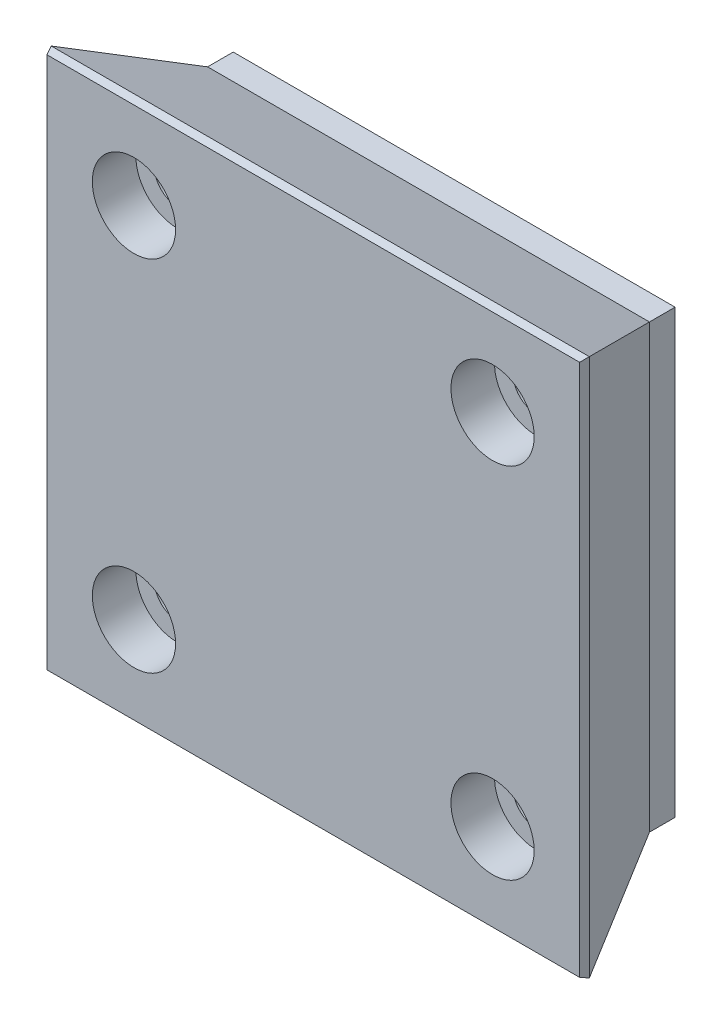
ISO-10303-21;
HEADER;
FILE_DESCRIPTION(('STEP AP214'),'2;1');
FILE_NAME('part.step','',(''),(''),'','','');
FILE_SCHEMA(('AUTOMOTIVE_DESIGN { 1 0 10303 214 1 1 1 1 }'));
ENDSEC;
DATA;
#1=APPLICATION_CONTEXT('core data for automotive mechanical design processes');
#2=APPLICATION_PROTOCOL_DEFINITION('international standard','automotive_design',2000,#1);
#3=PRODUCT_CONTEXT('',#1,'mechanical');
#4=PRODUCT('Part','Part','',(#3));
#5=PRODUCT_RELATED_PRODUCT_CATEGORY('part','',(#4));
#6=PRODUCT_DEFINITION_FORMATION('','',#4);
#7=PRODUCT_DEFINITION_CONTEXT('part definition',#1,'design');
#8=PRODUCT_DEFINITION('design','',#6,#7);
#9=PRODUCT_DEFINITION_SHAPE('','',#8);
#10=(LENGTH_UNIT() NAMED_UNIT(*) SI_UNIT(.MILLI.,.METRE.));
#11=(NAMED_UNIT(*) PLANE_ANGLE_UNIT() SI_UNIT($,.RADIAN.));
#12=(NAMED_UNIT(*) SI_UNIT($,.STERADIAN.) SOLID_ANGLE_UNIT());
#13=UNCERTAINTY_MEASURE_WITH_UNIT(LENGTH_MEASURE(1.E-05),#10,'distance_accuracy_value','');
#14=(GEOMETRIC_REPRESENTATION_CONTEXT(3) GLOBAL_UNCERTAINTY_ASSIGNED_CONTEXT((#13)) GLOBAL_UNIT_ASSIGNED_CONTEXT((#10,
#11,#12)) REPRESENTATION_CONTEXT('',''));
#15=CARTESIAN_POINT('',(0.,0.,0.));
#16=DIRECTION('',(0.,0.,1.));
#17=DIRECTION('',(1.,0.,0.));
#18=AXIS2_PLACEMENT_3D('',#15,#16,#17);
#19=CARTESIAN_POINT('',(17.25,-17.25,2.));
#20=DIRECTION('',(-1.,0.,0.));
#21=DIRECTION('',(0.,0.,1.));
#22=AXIS2_PLACEMENT_3D('',#19,#20,#21);
#23=PLANE('',#22);
#24=DIRECTION('',(0.,1.,0.));
#25=VECTOR('',#24,1.);
#26=CARTESIAN_POINT('',(17.25,-17.25,0.));
#27=LINE('',#26,#25);
#28=CARTESIAN_POINT('',(17.25,-17.25,0.));
#29=VERTEX_POINT('',#28);
#30=CARTESIAN_POINT('',(17.25,17.25,0.));
#31=VERTEX_POINT('',#30);
#32=EDGE_CURVE('E123',#29,#31,#27,.T.);
#33=ORIENTED_EDGE('',*,*,#32,.T.);
#34=DIRECTION('',(0.,0.,-1.));
#35=VECTOR('',#34,1.);
#36=CARTESIAN_POINT('',(17.25,17.25,2.));
#37=LINE('',#36,#35);
#38=CARTESIAN_POINT('',(17.25,17.25,2.));
#39=VERTEX_POINT('',#38);
#40=EDGE_CURVE('E131',#39,#31,#37,.T.);
#41=ORIENTED_EDGE('',*,*,#40,.F.);
#42=DIRECTION('',(0.,1.,0.));
#43=VECTOR('',#42,1.);
#44=CARTESIAN_POINT('',(17.25,0.,2.));
#45=LINE('',#44,#43);
#46=CARTESIAN_POINT('',(17.25,-17.25,2.));
#47=VERTEX_POINT('',#46);
#48=EDGE_CURVE('E155',#47,#39,#45,.T.);
#49=ORIENTED_EDGE('',*,*,#48,.F.);
#50=DIRECTION('',(0.,0.,-1.));
#51=VECTOR('',#50,1.);
#52=CARTESIAN_POINT('',(17.25,-17.25,2.));
#53=LINE('',#52,#51);
#54=EDGE_CURVE('E143',#47,#29,#53,.T.);
#55=ORIENTED_EDGE('',*,*,#54,.T.);
#56=EDGE_LOOP('',(#33,#41,#49,#55));
#57=FACE_BOUND('',#56,.T.);
#58=ADVANCED_FACE('F51',(#57),#23,.F.);
#59=CARTESIAN_POINT('',(-17.25,17.25,2.));
#60=DIRECTION('',(0.,-1.,0.));
#61=DIRECTION('',(0.,0.,-1.));
#62=AXIS2_PLACEMENT_3D('',#59,#60,#61);
#63=PLANE('',#62);
#64=DIRECTION('',(-1.,0.,0.));
#65=VECTOR('',#64,1.);
#66=CARTESIAN_POINT('',(-17.25,17.25,0.));
#67=LINE('',#66,#65);
#68=CARTESIAN_POINT('',(-17.25,17.25,0.));
#69=VERTEX_POINT('',#68);
#70=EDGE_CURVE('E118',#31,#69,#67,.T.);
#71=ORIENTED_EDGE('',*,*,#70,.T.);
#72=DIRECTION('',(0.,0.,-1.));
#73=VECTOR('',#72,1.);
#74=CARTESIAN_POINT('',(-17.25,17.25,2.));
#75=LINE('',#74,#73);
#76=CARTESIAN_POINT('',(-17.25,17.25,2.));
#77=VERTEX_POINT('',#76);
#78=EDGE_CURVE('E139',#77,#69,#75,.T.);
#79=ORIENTED_EDGE('',*,*,#78,.F.);
#80=DIRECTION('',(1.,0.,0.));
#81=VECTOR('',#80,1.);
#82=CARTESIAN_POINT('',(0.,17.25,2.));
#83=LINE('',#82,#81);
#84=EDGE_CURVE('E134',#39,#77,#83,.F.);
#85=ORIENTED_EDGE('',*,*,#84,.F.);
#86=ORIENTED_EDGE('',*,*,#40,.T.);
#87=EDGE_LOOP('',(#71,#79,#85,#86));
#88=FACE_BOUND('',#87,.T.);
#89=ADVANCED_FACE('F132',(#88),#63,.F.);
#90=CARTESIAN_POINT('',(-17.25,-17.25,2.));
#91=DIRECTION('',(1.,0.,0.));
#92=DIRECTION('',(0.,0.,-1.));
#93=AXIS2_PLACEMENT_3D('',#90,#91,#92);
#94=PLANE('',#93);
#95=DIRECTION('',(0.,-1.,0.));
#96=VECTOR('',#95,1.);
#97=CARTESIAN_POINT('',(-17.25,-17.25,0.));
#98=LINE('',#97,#96);
#99=CARTESIAN_POINT('',(-17.25,-17.25,0.));
#100=VERTEX_POINT('',#99);
#101=EDGE_CURVE('E124',#69,#100,#98,.T.);
#102=ORIENTED_EDGE('',*,*,#101,.T.);
#103=DIRECTION('',(0.,0.,-1.));
#104=VECTOR('',#103,1.);
#105=CARTESIAN_POINT('',(-17.25,-17.25,2.));
#106=LINE('',#105,#104);
#107=CARTESIAN_POINT('',(-17.25,-17.25,2.));
#108=VERTEX_POINT('',#107);
#109=EDGE_CURVE('E157',#108,#100,#106,.T.);
#110=ORIENTED_EDGE('',*,*,#109,.F.);
#111=DIRECTION('',(0.,1.,0.));
#112=VECTOR('',#111,1.);
#113=CARTESIAN_POINT('',(-17.25,0.,2.));
#114=LINE('',#113,#112);
#115=EDGE_CURVE('E165',#77,#108,#114,.F.);
#116=ORIENTED_EDGE('',*,*,#115,.F.);
#117=ORIENTED_EDGE('',*,*,#78,.T.);
#118=EDGE_LOOP('',(#102,#110,#116,#117));
#119=FACE_BOUND('',#118,.T.);
#120=ADVANCED_FACE('F247',(#119),#94,.F.);
#121=CARTESIAN_POINT('',(-17.25,-17.25,2.));
#122=DIRECTION('',(0.,1.,0.));
#123=DIRECTION('',(0.,0.,1.));
#124=AXIS2_PLACEMENT_3D('',#121,#122,#123);
#125=PLANE('',#124);
#126=DIRECTION('',(1.,0.,0.));
#127=VECTOR('',#126,1.);
#128=CARTESIAN_POINT('',(-17.25,-17.25,0.));
#129=LINE('',#128,#127);
#130=EDGE_CURVE('E153',#100,#29,#129,.T.);
#131=ORIENTED_EDGE('',*,*,#130,.T.);
#132=ORIENTED_EDGE('',*,*,#54,.F.);
#133=DIRECTION('',(1.,0.,0.));
#134=VECTOR('',#133,1.);
#135=CARTESIAN_POINT('',(0.,-17.25,2.));
#136=LINE('',#135,#134);
#137=EDGE_CURVE('E158',#108,#47,#136,.T.);
#138=ORIENTED_EDGE('',*,*,#137,.F.);
#139=ORIENTED_EDGE('',*,*,#109,.T.);
#140=EDGE_LOOP('',(#131,#132,#138,#139));
#141=FACE_BOUND('',#140,.T.);
#142=ADVANCED_FACE('F236',(#141),#125,.F.);
#143=CARTESIAN_POINT('',(0.,0.,0.));
#144=DIRECTION('',(0.,0.,-1.));
#145=DIRECTION('',(-1.,0.,0.));
#146=AXIS2_PLACEMENT_3D('',#143,#144,#145);
#147=PLANE('',#146);
#148=CARTESIAN_POINT('',(-14.,14.,0.));
#149=DIRECTION('',(0.,0.,1.));
#150=DIRECTION('',(1.,0.,0.));
#151=AXIS2_PLACEMENT_3D('',#148,#149,#150);
#152=CIRCLE('',#151,1.8);
#153=CARTESIAN_POINT('',(-12.2,14.,0.));
#154=VERTEX_POINT('',#153);
#155=EDGE_CURVE('E428',#154,#154,#152,.T.);
#156=ORIENTED_EDGE('',*,*,#155,.T.);
#157=EDGE_LOOP('',(#156));
#158=FACE_BOUND('',#157,.T.);
#159=CARTESIAN_POINT('',(14.,14.,0.));
#160=DIRECTION('',(0.,0.,1.));
#161=DIRECTION('',(1.,0.,0.));
#162=AXIS2_PLACEMENT_3D('',#159,#160,#161);
#163=CIRCLE('',#162,1.8);
#164=CARTESIAN_POINT('',(15.8,14.,0.));
#165=VERTEX_POINT('',#164);
#166=EDGE_CURVE('E440',#165,#165,#163,.T.);
#167=ORIENTED_EDGE('',*,*,#166,.T.);
#168=EDGE_LOOP('',(#167));
#169=FACE_BOUND('',#168,.T.);
#170=CARTESIAN_POINT('',(14.,-14.,0.));
#171=DIRECTION('',(0.,0.,1.));
#172=DIRECTION('',(1.,0.,0.));
#173=AXIS2_PLACEMENT_3D('',#170,#171,#172);
#174=CIRCLE('',#173,1.8);
#175=CARTESIAN_POINT('',(15.8,-14.,0.));
#176=VERTEX_POINT('',#175);
#177=EDGE_CURVE('E452',#176,#176,#174,.T.);
#178=ORIENTED_EDGE('',*,*,#177,.T.);
#179=EDGE_LOOP('',(#178));
#180=FACE_BOUND('',#179,.T.);
#181=CARTESIAN_POINT('',(-14.,-14.,0.));
#182=DIRECTION('',(0.,0.,1.));
#183=DIRECTION('',(1.,0.,0.));
#184=AXIS2_PLACEMENT_3D('',#181,#182,#183);
#185=CIRCLE('',#184,1.8);
#186=CARTESIAN_POINT('',(-12.2,-14.,0.));
#187=VERTEX_POINT('',#186);
#188=EDGE_CURVE('E185',#187,#187,#185,.T.);
#189=ORIENTED_EDGE('',*,*,#188,.T.);
#190=EDGE_LOOP('',(#189));
#191=FACE_BOUND('',#190,.T.);
#192=ORIENTED_EDGE('',*,*,#32,.F.);
#193=ORIENTED_EDGE('',*,*,#130,.F.);
#194=ORIENTED_EDGE('',*,*,#101,.F.);
#195=ORIENTED_EDGE('',*,*,#70,.F.);
#196=EDGE_LOOP('',(#192,#193,#194,#195));
#197=FACE_BOUND('',#196,.T.);
#198=ADVANCED_FACE('F120',(#158,#169,#180,#191,#197),#147,.T.);
#199=CARTESIAN_POINT('',(0.,0.,11.));
#200=DIRECTION('',(0.,0.,-1.));
#201=DIRECTION('',(-1.,0.,0.));
#202=AXIS2_PLACEMENT_3D('',#199,#200,#201);
#203=PLANE('',#202);
#204=CARTESIAN_POINT('',(-14.,14.,11.));
#205=DIRECTION('',(0.,0.,1.));
#206=DIRECTION('',(1.,0.,0.));
#207=AXIS2_PLACEMENT_3D('',#204,#205,#206);
#208=CIRCLE('',#207,3.25);
#209=CARTESIAN_POINT('',(-10.75,14.,11.));
#210=VERTEX_POINT('',#209);
#211=EDGE_CURVE('E421',#210,#210,#208,.T.);
#212=ORIENTED_EDGE('',*,*,#211,.F.);
#213=EDGE_LOOP('',(#212));
#214=FACE_BOUND('',#213,.T.);
#215=CARTESIAN_POINT('',(14.,14.,11.));
#216=DIRECTION('',(0.,0.,1.));
#217=DIRECTION('',(1.,0.,0.));
#218=AXIS2_PLACEMENT_3D('',#215,#216,#217);
#219=CIRCLE('',#218,3.25);
#220=CARTESIAN_POINT('',(17.25,14.,11.));
#221=VERTEX_POINT('',#220);
#222=EDGE_CURVE('E431',#221,#221,#219,.T.);
#223=ORIENTED_EDGE('',*,*,#222,.F.);
#224=EDGE_LOOP('',(#223));
#225=FACE_BOUND('',#224,.T.);
#226=CARTESIAN_POINT('',(14.,-14.,11.));
#227=DIRECTION('',(0.,0.,1.));
#228=DIRECTION('',(1.,0.,0.));
#229=AXIS2_PLACEMENT_3D('',#226,#227,#228);
#230=CIRCLE('',#229,3.25);
#231=CARTESIAN_POINT('',(17.25,-14.,11.));
#232=VERTEX_POINT('',#231);
#233=EDGE_CURVE('E443',#232,#232,#230,.T.);
#234=ORIENTED_EDGE('',*,*,#233,.F.);
#235=EDGE_LOOP('',(#234));
#236=FACE_BOUND('',#235,.T.);
#237=CARTESIAN_POINT('',(-14.,-14.,11.));
#238=DIRECTION('',(0.,0.,1.));
#239=DIRECTION('',(1.,0.,0.));
#240=AXIS2_PLACEMENT_3D('',#237,#238,#239);
#241=CIRCLE('',#240,3.25);
#242=CARTESIAN_POINT('',(-10.75,-14.,11.));
#243=VERTEX_POINT('',#242);
#244=EDGE_CURVE('E455',#243,#243,#241,.T.);
#245=ORIENTED_EDGE('',*,*,#244,.F.);
#246=EDGE_LOOP('',(#245));
#247=FACE_BOUND('',#246,.T.);
#248=DIRECTION('',(0.,-1.,0.));
#249=VECTOR('',#248,1.);
#250=CARTESIAN_POINT('',(-20.7954373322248,-21.25,11.));
#251=LINE('',#250,#249);
#252=CARTESIAN_POINT('',(-20.7954373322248,20.7954373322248,11.));
#253=VERTEX_POINT('',#252);
#254=CARTESIAN_POINT('',(-20.7954373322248,-20.7954373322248,11.));
#255=VERTEX_POINT('',#254);
#256=EDGE_CURVE('E172',#253,#255,#251,.T.);
#257=ORIENTED_EDGE('',*,*,#256,.T.);
#258=DIRECTION('',(1.,0.,0.));
#259=VECTOR('',#258,1.);
#260=CARTESIAN_POINT('',(21.25,-20.7954373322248,11.));
#261=LINE('',#260,#259);
#262=CARTESIAN_POINT('',(20.7954373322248,-20.7954373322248,11.));
#263=VERTEX_POINT('',#262);
#264=EDGE_CURVE('E174',#255,#263,#261,.T.);
#265=ORIENTED_EDGE('',*,*,#264,.T.);
#266=DIRECTION('',(0.,1.,0.));
#267=VECTOR('',#266,1.);
#268=CARTESIAN_POINT('',(20.7954373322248,21.25,11.));
#269=LINE('',#268,#267);
#270=CARTESIAN_POINT('',(20.7954373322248,20.7954373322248,11.));
#271=VERTEX_POINT('',#270);
#272=EDGE_CURVE('E138',#263,#271,#269,.T.);
#273=ORIENTED_EDGE('',*,*,#272,.T.);
#274=DIRECTION('',(-1.,0.,0.));
#275=VECTOR('',#274,1.);
#276=CARTESIAN_POINT('',(-21.25,20.7954373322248,11.));
#277=LINE('',#276,#275);
#278=EDGE_CURVE('E170',#271,#253,#277,.T.);
#279=ORIENTED_EDGE('',*,*,#278,.T.);
#280=EDGE_LOOP('',(#257,#265,#273,#279));
#281=FACE_BOUND('',#280,.T.);
#282=ADVANCED_FACE('F225',(#214,#225,#236,#247,#281),#203,.F.);
#283=CARTESIAN_POINT('',(-13.6623711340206,0.,-6.07216494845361));
#284=DIRECTION('',(-0.913811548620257,0.,-0.406138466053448));
#285=DIRECTION('',(-0.406138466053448,0.,0.913811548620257));
#286=AXIS2_PLACEMENT_3D('',#283,#284,#285);
#287=PLANE('',#286);
#288=DIRECTION('',(0.376288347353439,0.376288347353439,-0.846648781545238));
#289=VECTOR('',#288,1.);
#290=CARTESIAN_POINT('',(-21.25,-21.25,11.));
#291=LINE('',#290,#289);
#292=CARTESIAN_POINT('',(-21.0063169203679,-21.0063169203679,10.4517130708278));
#293=VERTEX_POINT('',#292);
#294=EDGE_CURVE('E178',#293,#108,#291,.T.);
#295=ORIENTED_EDGE('',*,*,#294,.F.);
#296=DIRECTION('',(0.,1.,0.));
#297=VECTOR('',#296,1.);
#298=CARTESIAN_POINT('',(-21.0063169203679,21.25,10.4517130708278));
#299=LINE('',#298,#297);
#300=CARTESIAN_POINT('',(-21.0063169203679,21.0063169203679,10.4517130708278));
#301=VERTEX_POINT('',#300);
#302=EDGE_CURVE('E76',#293,#301,#299,.T.);
#303=ORIENTED_EDGE('',*,*,#302,.T.);
#304=DIRECTION('',(0.376288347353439,-0.376288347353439,-0.846648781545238));
#305=VECTOR('',#304,1.);
#306=CARTESIAN_POINT('',(-21.25,21.25,11.));
#307=LINE('',#306,#305);
#308=EDGE_CURVE('E180',#301,#77,#307,.T.);
#309=ORIENTED_EDGE('',*,*,#308,.T.);
#310=ORIENTED_EDGE('',*,*,#115,.T.);
#311=EDGE_LOOP('',(#295,#303,#309,#310));
#312=FACE_BOUND('',#311,.T.);
#313=ADVANCED_FACE('F227',(#312),#287,.T.);
#314=CARTESIAN_POINT('',(0.,-13.6623711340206,-6.07216494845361));
#315=DIRECTION('',(0.,-0.913811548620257,-0.406138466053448));
#316=DIRECTION('',(0.,0.406138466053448,-0.913811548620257));
#317=AXIS2_PLACEMENT_3D('',#314,#315,#316);
#318=PLANE('',#317);
#319=DIRECTION('',(-0.376288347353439,0.376288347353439,-0.846648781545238));
#320=VECTOR('',#319,1.);
#321=CARTESIAN_POINT('',(21.25,-21.25,11.));
#322=LINE('',#321,#320);
#323=CARTESIAN_POINT('',(21.0063169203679,-21.0063169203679,10.4517130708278));
#324=VERTEX_POINT('',#323);
#325=EDGE_CURVE('E144',#324,#47,#322,.T.);
#326=ORIENTED_EDGE('',*,*,#325,.F.);
#327=DIRECTION('',(-1.,0.,0.));
#328=VECTOR('',#327,1.);
#329=CARTESIAN_POINT('',(-21.25,-21.0063169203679,10.4517130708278));
#330=LINE('',#329,#328);
#331=EDGE_CURVE('E177',#324,#293,#330,.T.);
#332=ORIENTED_EDGE('',*,*,#331,.T.);
#333=ORIENTED_EDGE('',*,*,#294,.T.);
#334=ORIENTED_EDGE('',*,*,#137,.T.);
#335=EDGE_LOOP('',(#326,#332,#333,#334));
#336=FACE_BOUND('',#335,.T.);
#337=ADVANCED_FACE('F219',(#336),#318,.T.);
#338=CARTESIAN_POINT('',(0.,13.6623711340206,-6.07216494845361));
#339=DIRECTION('',(0.,0.913811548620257,-0.406138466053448));
#340=DIRECTION('',(0.,0.406138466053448,0.913811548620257));
#341=AXIS2_PLACEMENT_3D('',#338,#339,#340);
#342=PLANE('',#341);
#343=ORIENTED_EDGE('',*,*,#308,.F.);
#344=DIRECTION('',(1.,0.,0.));
#345=VECTOR('',#344,1.);
#346=CARTESIAN_POINT('',(21.25,21.0063169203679,10.4517130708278));
#347=LINE('',#346,#345);
#348=CARTESIAN_POINT('',(21.0063169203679,21.0063169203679,10.4517130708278));
#349=VERTEX_POINT('',#348);
#350=EDGE_CURVE('E61',#301,#349,#347,.T.);
#351=ORIENTED_EDGE('',*,*,#350,.T.);
#352=DIRECTION('',(-0.376288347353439,-0.376288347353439,-0.846648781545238));
#353=VECTOR('',#352,1.);
#354=CARTESIAN_POINT('',(21.25,21.25,11.));
#355=LINE('',#354,#353);
#356=EDGE_CURVE('E146',#349,#39,#355,.T.);
#357=ORIENTED_EDGE('',*,*,#356,.T.);
#358=ORIENTED_EDGE('',*,*,#84,.T.);
#359=EDGE_LOOP('',(#343,#351,#357,#358));
#360=FACE_BOUND('',#359,.T.);
#361=ADVANCED_FACE('F271',(#360),#342,.T.);
#362=CARTESIAN_POINT('',(13.6623711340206,0.,-6.07216494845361));
#363=DIRECTION('',(0.913811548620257,0.,-0.406138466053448));
#364=DIRECTION('',(-0.406138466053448,0.,-0.913811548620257));
#365=AXIS2_PLACEMENT_3D('',#362,#363,#364);
#366=PLANE('',#365);
#367=ORIENTED_EDGE('',*,*,#356,.F.);
#368=DIRECTION('',(0.,-1.,0.));
#369=VECTOR('',#368,1.);
#370=CARTESIAN_POINT('',(21.0063169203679,-21.25,10.4517130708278));
#371=LINE('',#370,#369);
#372=EDGE_CURVE('E12',#349,#324,#371,.T.);
#373=ORIENTED_EDGE('',*,*,#372,.T.);
#374=ORIENTED_EDGE('',*,*,#325,.T.);
#375=ORIENTED_EDGE('',*,*,#48,.T.);
#376=EDGE_LOOP('',(#367,#373,#374,#375));
#377=FACE_BOUND('',#376,.T.);
#378=ADVANCED_FACE('F216',(#377),#366,.T.);
#379=CARTESIAN_POINT('',(0.,20.7954373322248,11.));
#380=DIRECTION('',(0.,0.933345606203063,0.358979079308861));
#381=DIRECTION('',(1.,0.,0.));
#382=AXIS2_PLACEMENT_3D('',#379,#380,#381);
#383=PLANE('',#382);
#384=DIRECTION('',(-0.337868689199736,-0.337868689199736,0.878458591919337));
#385=VECTOR('',#384,1.);
#386=CARTESIAN_POINT('',(18.4215289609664,18.4215289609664,17.1721617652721));
#387=LINE('',#386,#385);
#388=EDGE_CURVE('E197',#349,#271,#387,.T.);
#389=ORIENTED_EDGE('',*,*,#388,.F.);
#390=ORIENTED_EDGE('',*,*,#350,.F.);
#391=DIRECTION('',(0.337868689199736,-0.337868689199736,0.878458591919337));
#392=VECTOR('',#391,1.);
#393=CARTESIAN_POINT('',(-18.4215289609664,18.4215289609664,17.1721617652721));
#394=LINE('',#393,#392);
#395=EDGE_CURVE('E56',#253,#301,#394,.F.);
#396=ORIENTED_EDGE('',*,*,#395,.F.);
#397=ORIENTED_EDGE('',*,*,#278,.F.);
#398=EDGE_LOOP('',(#389,#390,#396,#397));
#399=FACE_BOUND('',#398,.T.);
#400=ADVANCED_FACE('F54',(#399),#383,.T.);
#401=CARTESIAN_POINT('',(-20.7954373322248,0.,11.));
#402=DIRECTION('',(-0.933345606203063,0.,0.358979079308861));
#403=DIRECTION('',(0.,1.,0.));
#404=AXIS2_PLACEMENT_3D('',#401,#402,#403);
#405=PLANE('',#404);
#406=ORIENTED_EDGE('',*,*,#395,.T.);
#407=ORIENTED_EDGE('',*,*,#302,.F.);
#408=DIRECTION('',(0.337868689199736,0.337868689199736,0.878458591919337));
#409=VECTOR('',#408,1.);
#410=CARTESIAN_POINT('',(-18.4215289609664,-18.4215289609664,17.1721617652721));
#411=LINE('',#410,#409);
#412=EDGE_CURVE('E196',#255,#293,#411,.F.);
#413=ORIENTED_EDGE('',*,*,#412,.F.);
#414=ORIENTED_EDGE('',*,*,#256,.F.);
#415=EDGE_LOOP('',(#406,#407,#413,#414));
#416=FACE_BOUND('',#415,.T.);
#417=ADVANCED_FACE('F207',(#416),#405,.T.);
#418=CARTESIAN_POINT('',(20.7954373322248,0.,11.));
#419=DIRECTION('',(0.933345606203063,0.,0.358979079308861));
#420=DIRECTION('',(0.,-1.,0.));
#421=AXIS2_PLACEMENT_3D('',#418,#419,#420);
#422=PLANE('',#421);
#423=ORIENTED_EDGE('',*,*,#388,.T.);
#424=ORIENTED_EDGE('',*,*,#272,.F.);
#425=DIRECTION('',(0.337868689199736,-0.337868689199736,-0.878458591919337));
#426=VECTOR('',#425,1.);
#427=CARTESIAN_POINT('',(18.4215289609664,-18.4215289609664,17.1721617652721));
#428=LINE('',#427,#426);
#429=EDGE_CURVE('E194',#324,#263,#428,.F.);
#430=ORIENTED_EDGE('',*,*,#429,.F.);
#431=ORIENTED_EDGE('',*,*,#372,.F.);
#432=EDGE_LOOP('',(#423,#424,#430,#431));
#433=FACE_BOUND('',#432,.T.);
#434=ADVANCED_FACE('F213',(#433),#422,.T.);
#435=CARTESIAN_POINT('',(0.,-20.7954373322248,11.));
#436=DIRECTION('',(0.,-0.933345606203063,0.358979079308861));
#437=DIRECTION('',(-1.,0.,0.));
#438=AXIS2_PLACEMENT_3D('',#435,#436,#437);
#439=PLANE('',#438);
#440=ORIENTED_EDGE('',*,*,#412,.T.);
#441=ORIENTED_EDGE('',*,*,#331,.F.);
#442=ORIENTED_EDGE('',*,*,#429,.T.);
#443=ORIENTED_EDGE('',*,*,#264,.F.);
#444=EDGE_LOOP('',(#440,#441,#442,#443));
#445=FACE_BOUND('',#444,.T.);
#446=ADVANCED_FACE('F222',(#445),#439,.T.);
#447=CARTESIAN_POINT('',(-14.,-14.,11.));
#448=DIRECTION('',(0.,0.,1.));
#449=DIRECTION('',(1.,0.,0.));
#450=AXIS2_PLACEMENT_3D('',#447,#448,#449);
#451=CYLINDRICAL_SURFACE('',#450,1.8);
#452=ORIENTED_EDGE('',*,*,#188,.F.);
#453=EDGE_LOOP('',(#452));
#454=FACE_BOUND('',#453,.T.);
#455=CARTESIAN_POINT('',(-14.,-14.,7.6));
#456=DIRECTION('',(0.,0.,1.));
#457=DIRECTION('',(1.,0.,0.));
#458=AXIS2_PLACEMENT_3D('',#455,#456,#457);
#459=CIRCLE('',#458,1.8);
#460=CARTESIAN_POINT('',(-12.2,-14.,7.6));
#461=VERTEX_POINT('',#460);
#462=EDGE_CURVE('E460',#461,#461,#459,.T.);
#463=ORIENTED_EDGE('',*,*,#462,.T.);
#464=EDGE_LOOP('',(#463));
#465=FACE_BOUND('',#464,.T.);
#466=ADVANCED_FACE('F257',(#454,#465),#451,.F.);
#467=CARTESIAN_POINT('',(-12.2,-14.,7.6));
#468=DIRECTION('',(0.,0.,-1.));
#469=DIRECTION('',(-1.,0.,0.));
#470=AXIS2_PLACEMENT_3D('',#467,#468,#469);
#471=PLANE('',#470);
#472=ORIENTED_EDGE('',*,*,#462,.F.);
#473=EDGE_LOOP('',(#472));
#474=FACE_BOUND('',#473,.T.);
#475=CARTESIAN_POINT('',(-14.,-14.,7.6));
#476=DIRECTION('',(0.,0.,1.));
#477=DIRECTION('',(1.,0.,0.));
#478=AXIS2_PLACEMENT_3D('',#475,#476,#477);
#479=CIRCLE('',#478,3.25);
#480=CARTESIAN_POINT('',(-10.75,-14.,7.6));
#481=VERTEX_POINT('',#480);
#482=EDGE_CURVE('E458',#481,#481,#479,.T.);
#483=ORIENTED_EDGE('',*,*,#482,.T.);
#484=EDGE_LOOP('',(#483));
#485=FACE_BOUND('',#484,.T.);
#486=ADVANCED_FACE('F327',(#474,#485),#471,.F.);
#487=CARTESIAN_POINT('',(-14.,-14.,11.));
#488=DIRECTION('',(0.,0.,1.));
#489=DIRECTION('',(1.,0.,0.));
#490=AXIS2_PLACEMENT_3D('',#487,#488,#489);
#491=CYLINDRICAL_SURFACE('',#490,3.25);
#492=ORIENTED_EDGE('',*,*,#482,.F.);
#493=EDGE_LOOP('',(#492));
#494=FACE_BOUND('',#493,.T.);
#495=ORIENTED_EDGE('',*,*,#244,.T.);
#496=EDGE_LOOP('',(#495));
#497=FACE_BOUND('',#496,.T.);
#498=ADVANCED_FACE('F334',(#494,#497),#491,.F.);
#499=CARTESIAN_POINT('',(14.,-14.,11.));
#500=DIRECTION('',(0.,0.,1.));
#501=DIRECTION('',(1.,0.,0.));
#502=AXIS2_PLACEMENT_3D('',#499,#500,#501);
#503=CYLINDRICAL_SURFACE('',#502,1.8);
#504=ORIENTED_EDGE('',*,*,#177,.F.);
#505=EDGE_LOOP('',(#504));
#506=FACE_BOUND('',#505,.T.);
#507=CARTESIAN_POINT('',(14.,-14.,7.6));
#508=DIRECTION('',(0.,0.,1.));
#509=DIRECTION('',(1.,0.,0.));
#510=AXIS2_PLACEMENT_3D('',#507,#508,#509);
#511=CIRCLE('',#510,1.8);
#512=CARTESIAN_POINT('',(15.8,-14.,7.6));
#513=VERTEX_POINT('',#512);
#514=EDGE_CURVE('E449',#513,#513,#511,.T.);
#515=ORIENTED_EDGE('',*,*,#514,.T.);
#516=EDGE_LOOP('',(#515));
#517=FACE_BOUND('',#516,.T.);
#518=ADVANCED_FACE('F342',(#506,#517),#503,.F.);
#519=CARTESIAN_POINT('',(15.8,-14.,7.6));
#520=DIRECTION('',(0.,0.,-1.));
#521=DIRECTION('',(-1.,0.,0.));
#522=AXIS2_PLACEMENT_3D('',#519,#520,#521);
#523=PLANE('',#522);
#524=ORIENTED_EDGE('',*,*,#514,.F.);
#525=EDGE_LOOP('',(#524));
#526=FACE_BOUND('',#525,.T.);
#527=CARTESIAN_POINT('',(14.,-14.,7.6));
#528=DIRECTION('',(0.,0.,1.));
#529=DIRECTION('',(1.,0.,0.));
#530=AXIS2_PLACEMENT_3D('',#527,#528,#529);
#531=CIRCLE('',#530,3.25);
#532=CARTESIAN_POINT('',(17.25,-14.,7.6));
#533=VERTEX_POINT('',#532);
#534=EDGE_CURVE('E446',#533,#533,#531,.T.);
#535=ORIENTED_EDGE('',*,*,#534,.T.);
#536=EDGE_LOOP('',(#535));
#537=FACE_BOUND('',#536,.T.);
#538=ADVANCED_FACE('F350',(#526,#537),#523,.F.);
#539=CARTESIAN_POINT('',(14.,-14.,11.));
#540=DIRECTION('',(0.,0.,1.));
#541=DIRECTION('',(1.,0.,0.));
#542=AXIS2_PLACEMENT_3D('',#539,#540,#541);
#543=CYLINDRICAL_SURFACE('',#542,3.25);
#544=ORIENTED_EDGE('',*,*,#534,.F.);
#545=EDGE_LOOP('',(#544));
#546=FACE_BOUND('',#545,.T.);
#547=ORIENTED_EDGE('',*,*,#233,.T.);
#548=EDGE_LOOP('',(#547));
#549=FACE_BOUND('',#548,.T.);
#550=ADVANCED_FACE('F358',(#546,#549),#543,.F.);
#551=CARTESIAN_POINT('',(14.,14.,11.));
#552=DIRECTION('',(0.,0.,1.));
#553=DIRECTION('',(1.,0.,0.));
#554=AXIS2_PLACEMENT_3D('',#551,#552,#553);
#555=CYLINDRICAL_SURFACE('',#554,1.8);
#556=ORIENTED_EDGE('',*,*,#166,.F.);
#557=EDGE_LOOP('',(#556));
#558=FACE_BOUND('',#557,.T.);
#559=CARTESIAN_POINT('',(14.,14.,7.6));
#560=DIRECTION('',(0.,0.,1.));
#561=DIRECTION('',(1.,0.,0.));
#562=AXIS2_PLACEMENT_3D('',#559,#560,#561);
#563=CIRCLE('',#562,1.8);
#564=CARTESIAN_POINT('',(15.8,14.,7.6));
#565=VERTEX_POINT('',#564);
#566=EDGE_CURVE('E437',#565,#565,#563,.T.);
#567=ORIENTED_EDGE('',*,*,#566,.T.);
#568=EDGE_LOOP('',(#567));
#569=FACE_BOUND('',#568,.T.);
#570=ADVANCED_FACE('F366',(#558,#569),#555,.F.);
#571=CARTESIAN_POINT('',(15.8,14.,7.6));
#572=DIRECTION('',(0.,0.,-1.));
#573=DIRECTION('',(-1.,0.,0.));
#574=AXIS2_PLACEMENT_3D('',#571,#572,#573);
#575=PLANE('',#574);
#576=ORIENTED_EDGE('',*,*,#566,.F.);
#577=EDGE_LOOP('',(#576));
#578=FACE_BOUND('',#577,.T.);
#579=CARTESIAN_POINT('',(14.,14.,7.6));
#580=DIRECTION('',(0.,0.,1.));
#581=DIRECTION('',(1.,0.,0.));
#582=AXIS2_PLACEMENT_3D('',#579,#580,#581);
#583=CIRCLE('',#582,3.25);
#584=CARTESIAN_POINT('',(17.25,14.,7.6));
#585=VERTEX_POINT('',#584);
#586=EDGE_CURVE('E434',#585,#585,#583,.T.);
#587=ORIENTED_EDGE('',*,*,#586,.T.);
#588=EDGE_LOOP('',(#587));
#589=FACE_BOUND('',#588,.T.);
#590=ADVANCED_FACE('F374',(#578,#589),#575,.F.);
#591=CARTESIAN_POINT('',(14.,14.,11.));
#592=DIRECTION('',(0.,0.,1.));
#593=DIRECTION('',(1.,0.,0.));
#594=AXIS2_PLACEMENT_3D('',#591,#592,#593);
#595=CYLINDRICAL_SURFACE('',#594,3.25);
#596=ORIENTED_EDGE('',*,*,#586,.F.);
#597=EDGE_LOOP('',(#596));
#598=FACE_BOUND('',#597,.T.);
#599=ORIENTED_EDGE('',*,*,#222,.T.);
#600=EDGE_LOOP('',(#599));
#601=FACE_BOUND('',#600,.T.);
#602=ADVANCED_FACE('F382',(#598,#601),#595,.F.);
#603=CARTESIAN_POINT('',(-14.,14.,11.));
#604=DIRECTION('',(0.,0.,1.));
#605=DIRECTION('',(1.,0.,0.));
#606=AXIS2_PLACEMENT_3D('',#603,#604,#605);
#607=CYLINDRICAL_SURFACE('',#606,1.8);
#608=ORIENTED_EDGE('',*,*,#155,.F.);
#609=EDGE_LOOP('',(#608));
#610=FACE_BOUND('',#609,.T.);
#611=CARTESIAN_POINT('',(-14.,14.,7.6));
#612=DIRECTION('',(0.,0.,1.));
#613=DIRECTION('',(1.,0.,0.));
#614=AXIS2_PLACEMENT_3D('',#611,#612,#613);
#615=CIRCLE('',#614,1.8);
#616=CARTESIAN_POINT('',(-12.2,14.,7.6));
#617=VERTEX_POINT('',#616);
#618=EDGE_CURVE('E423',#617,#617,#615,.T.);
#619=ORIENTED_EDGE('',*,*,#618,.T.);
#620=EDGE_LOOP('',(#619));
#621=FACE_BOUND('',#620,.T.);
#622=ADVANCED_FACE('F390',(#610,#621),#607,.F.);
#623=CARTESIAN_POINT('',(-12.2,14.,7.6));
#624=DIRECTION('',(0.,0.,-1.));
#625=DIRECTION('',(-1.,0.,0.));
#626=AXIS2_PLACEMENT_3D('',#623,#624,#625);
#627=PLANE('',#626);
#628=ORIENTED_EDGE('',*,*,#618,.F.);
#629=EDGE_LOOP('',(#628));
#630=FACE_BOUND('',#629,.T.);
#631=CARTESIAN_POINT('',(-14.,14.,7.6));
#632=DIRECTION('',(0.,0.,1.));
#633=DIRECTION('',(1.,0.,0.));
#634=AXIS2_PLACEMENT_3D('',#631,#632,#633);
#635=CIRCLE('',#634,3.25);
#636=CARTESIAN_POINT('',(-10.75,14.,7.6));
#637=VERTEX_POINT('',#636);
#638=EDGE_CURVE('E419',#637,#637,#635,.T.);
#639=ORIENTED_EDGE('',*,*,#638,.T.);
#640=EDGE_LOOP('',(#639));
#641=FACE_BOUND('',#640,.T.);
#642=ADVANCED_FACE('F398',(#630,#641),#627,.F.);
#643=CARTESIAN_POINT('',(-14.,14.,11.));
#644=DIRECTION('',(0.,0.,1.));
#645=DIRECTION('',(1.,0.,0.));
#646=AXIS2_PLACEMENT_3D('',#643,#644,#645);
#647=CYLINDRICAL_SURFACE('',#646,3.25);
#648=ORIENTED_EDGE('',*,*,#638,.F.);
#649=EDGE_LOOP('',(#648));
#650=FACE_BOUND('',#649,.T.);
#651=ORIENTED_EDGE('',*,*,#211,.T.);
#652=EDGE_LOOP('',(#651));
#653=FACE_BOUND('',#652,.T.);
#654=ADVANCED_FACE('F406',(#650,#653),#647,.F.);
#655=CLOSED_SHELL('',(#58,#89,#120,#142,#198,#282,#313,#337,#361,#378,#400,#417,#434,#446,#466,
#486,#498,#518,#538,#550,#570,#590,#602,#622,#642,#654));
#656=MANIFOLD_SOLID_BREP('B2',#655);
#657=ADVANCED_BREP_SHAPE_REPRESENTATION('',(#18,#656),#14);
#658=SHAPE_DEFINITION_REPRESENTATION(#9,#657);
ENDSEC;
END-ISO-10303-21;
